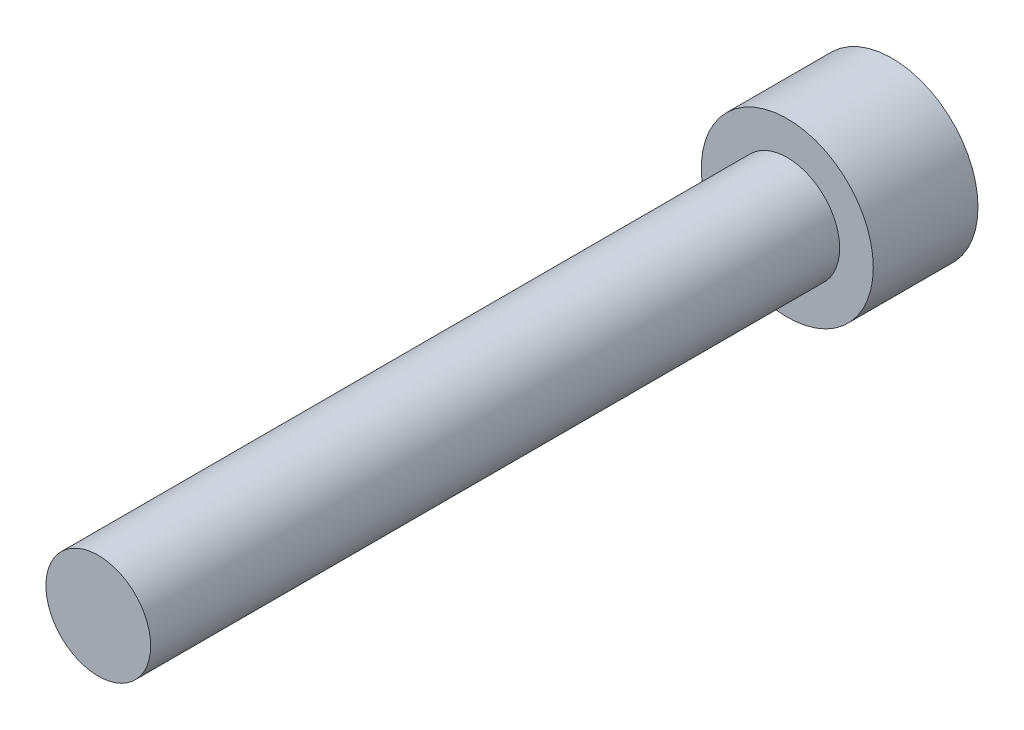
ISO-10303-21;
HEADER;
FILE_DESCRIPTION(('STEP AP214'),'2;1');
FILE_NAME('part.step','',(''),(''),'','','');
FILE_SCHEMA(('AUTOMOTIVE_DESIGN { 1 0 10303 214 1 1 1 1 }'));
ENDSEC;
DATA;
#1=APPLICATION_CONTEXT('core data for automotive mechanical design processes');
#2=APPLICATION_PROTOCOL_DEFINITION('international standard','automotive_design',2000,#1);
#3=PRODUCT_CONTEXT('',#1,'mechanical');
#4=PRODUCT('Part','Part','',(#3));
#5=PRODUCT_RELATED_PRODUCT_CATEGORY('part','',(#4));
#6=PRODUCT_DEFINITION_FORMATION('','',#4);
#7=PRODUCT_DEFINITION_CONTEXT('part definition',#1,'design');
#8=PRODUCT_DEFINITION('design','',#6,#7);
#9=PRODUCT_DEFINITION_SHAPE('','',#8);
#10=(LENGTH_UNIT() NAMED_UNIT(*) SI_UNIT(.MILLI.,.METRE.));
#11=(NAMED_UNIT(*) PLANE_ANGLE_UNIT() SI_UNIT($,.RADIAN.));
#12=(NAMED_UNIT(*) SI_UNIT($,.STERADIAN.) SOLID_ANGLE_UNIT());
#13=UNCERTAINTY_MEASURE_WITH_UNIT(LENGTH_MEASURE(1.E-05),#10,'distance_accuracy_value','');
#14=(GEOMETRIC_REPRESENTATION_CONTEXT(3) GLOBAL_UNCERTAINTY_ASSIGNED_CONTEXT((#13)) GLOBAL_UNIT_ASSIGNED_CONTEXT((#10,
#11,#12)) REPRESENTATION_CONTEXT('',''));
#15=CARTESIAN_POINT('',(0.,0.,0.));
#16=DIRECTION('',(0.,0.,1.));
#17=DIRECTION('',(1.,0.,0.));
#18=AXIS2_PLACEMENT_3D('',#15,#16,#17);
#19=CARTESIAN_POINT('',(0.,0.,31.75));
#20=DIRECTION('',(0.,0.,1.));
#21=DIRECTION('',(1.,0.,0.));
#22=AXIS2_PLACEMENT_3D('',#19,#20,#21);
#23=PLANE('',#22);
#24=CARTESIAN_POINT('',(0.,0.,31.75));
#25=DIRECTION('',(0.,0.,1.));
#26=DIRECTION('',(1.,0.,0.));
#27=AXIS2_PLACEMENT_3D('',#24,#25,#26);
#28=CIRCLE('',#27,2.413);
#29=CARTESIAN_POINT('',(2.413,0.,31.75));
#30=VERTEX_POINT('',#29);
#31=EDGE_CURVE('E11',#30,#30,#28,.T.);
#32=ORIENTED_EDGE('',*,*,#31,.T.);
#33=EDGE_LOOP('',(#32));
#34=FACE_BOUND('',#33,.T.);
#35=ADVANCED_FACE('F37',(#34),#23,.T.);
#36=CARTESIAN_POINT('',(0.,0.,31.75));
#37=DIRECTION('',(0.,0.,1.));
#38=DIRECTION('',(1.,0.,0.));
#39=AXIS2_PLACEMENT_3D('',#36,#37,#38);
#40=CYLINDRICAL_SURFACE('',#39,2.413);
#41=CARTESIAN_POINT('',(0.,0.,0.));
#42=DIRECTION('',(0.,0.,1.));
#43=DIRECTION('',(1.,0.,0.));
#44=AXIS2_PLACEMENT_3D('',#41,#42,#43);
#45=CIRCLE('',#44,2.413);
#46=CARTESIAN_POINT('',(2.413,0.,0.));
#47=VERTEX_POINT('',#46);
#48=EDGE_CURVE('E44',#47,#47,#45,.T.);
#49=ORIENTED_EDGE('',*,*,#48,.T.);
#50=EDGE_LOOP('',(#49));
#51=FACE_BOUND('',#50,.T.);
#52=ORIENTED_EDGE('',*,*,#31,.F.);
#53=EDGE_LOOP('',(#52));
#54=FACE_BOUND('',#53,.T.);
#55=ADVANCED_FACE('F151',(#51,#54),#40,.T.);
#56=CARTESIAN_POINT('',(0.,-2.413,0.));
#57=DIRECTION('',(0.,0.,1.));
#58=DIRECTION('',(1.,0.,0.));
#59=AXIS2_PLACEMENT_3D('',#56,#57,#58);
#60=PLANE('',#59);
#61=CARTESIAN_POINT('',(0.,0.,0.));
#62=DIRECTION('',(0.,0.,1.));
#63=DIRECTION('',(1.,0.,0.));
#64=AXIS2_PLACEMENT_3D('',#61,#62,#63);
#65=CIRCLE('',#64,3.9624);
#66=CARTESIAN_POINT('',(3.9624,0.,0.));
#67=VERTEX_POINT('',#66);
#68=EDGE_CURVE('E146',#67,#67,#65,.T.);
#69=ORIENTED_EDGE('',*,*,#68,.T.);
#70=EDGE_LOOP('',(#69));
#71=FACE_BOUND('',#70,.T.);
#72=ORIENTED_EDGE('',*,*,#48,.F.);
#73=EDGE_LOOP('',(#72));
#74=FACE_BOUND('',#73,.T.);
#75=ADVANCED_FACE('F154',(#71,#74),#60,.T.);
#76=CARTESIAN_POINT('',(0.,0.,31.75));
#77=DIRECTION('',(0.,0.,1.));
#78=DIRECTION('',(1.,0.,0.));
#79=AXIS2_PLACEMENT_3D('',#76,#77,#78);
#80=CYLINDRICAL_SURFACE('',#79,3.9624);
#81=CARTESIAN_POINT('',(0.,0.,-4.826));
#82=DIRECTION('',(0.,0.,1.));
#83=DIRECTION('',(1.,0.,0.));
#84=AXIS2_PLACEMENT_3D('',#81,#82,#83);
#85=CIRCLE('',#84,3.9624);
#86=CARTESIAN_POINT('',(3.9624,0.,-4.826));
#87=VERTEX_POINT('',#86);
#88=EDGE_CURVE('E138',#87,#87,#85,.T.);
#89=ORIENTED_EDGE('',*,*,#88,.T.);
#90=EDGE_LOOP('',(#89));
#91=FACE_BOUND('',#90,.T.);
#92=ORIENTED_EDGE('',*,*,#68,.F.);
#93=EDGE_LOOP('',(#92));
#94=FACE_BOUND('',#93,.T.);
#95=ADVANCED_FACE('F156',(#91,#94),#80,.T.);
#96=CARTESIAN_POINT('',(0.,-3.9624,-4.826));
#97=DIRECTION('',(0.,0.,-1.));
#98=DIRECTION('',(-1.,0.,0.));
#99=AXIS2_PLACEMENT_3D('',#96,#97,#98);
#100=PLANE('',#99);
#101=DIRECTION('',(0.866025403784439,-0.5,0.));
#102=VECTOR('',#101,1.);
#103=CARTESIAN_POINT('',(0.,2.28769270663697,-4.826));
#104=LINE('',#103,#102);
#105=CARTESIAN_POINT('',(0.,2.28769270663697,-4.826));
#106=VERTEX_POINT('',#105);
#107=CARTESIAN_POINT('',(1.9812,1.14384635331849,-4.826));
#108=VERTEX_POINT('',#107);
#109=EDGE_CURVE('E51',#106,#108,#104,.T.);
#110=ORIENTED_EDGE('',*,*,#109,.F.);
#111=DIRECTION('',(0.866025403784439,0.5,0.));
#112=VECTOR('',#111,1.);
#113=CARTESIAN_POINT('',(-1.9812,1.14384635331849,-4.826));
#114=LINE('',#113,#112);
#115=CARTESIAN_POINT('',(-1.9812,1.14384635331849,-4.826));
#116=VERTEX_POINT('',#115);
#117=EDGE_CURVE('E134',#116,#106,#114,.T.);
#118=ORIENTED_EDGE('',*,*,#117,.F.);
#119=DIRECTION('',(0.,1.,0.));
#120=VECTOR('',#119,1.);
#121=CARTESIAN_POINT('',(-1.9812,-1.14384635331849,-4.826));
#122=LINE('',#121,#120);
#123=CARTESIAN_POINT('',(-1.9812,-1.14384635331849,-4.826));
#124=VERTEX_POINT('',#123);
#125=EDGE_CURVE('E132',#124,#116,#122,.T.);
#126=ORIENTED_EDGE('',*,*,#125,.F.);
#127=DIRECTION('',(-0.866025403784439,0.5,0.));
#128=VECTOR('',#127,1.);
#129=CARTESIAN_POINT('',(0.,-2.28769270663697,-4.826));
#130=LINE('',#129,#128);
#131=CARTESIAN_POINT('',(0.,-2.28769270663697,-4.826));
#132=VERTEX_POINT('',#131);
#133=EDGE_CURVE('E99',#132,#124,#130,.T.);
#134=ORIENTED_EDGE('',*,*,#133,.F.);
#135=DIRECTION('',(-0.866025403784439,-0.5,0.));
#136=VECTOR('',#135,1.);
#137=CARTESIAN_POINT('',(1.9812,-1.14384635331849,-4.826));
#138=LINE('',#137,#136);
#139=CARTESIAN_POINT('',(1.9812,-1.14384635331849,-4.826));
#140=VERTEX_POINT('',#139);
#141=EDGE_CURVE('E128',#140,#132,#138,.T.);
#142=ORIENTED_EDGE('',*,*,#141,.F.);
#143=DIRECTION('',(0.,-1.,0.));
#144=VECTOR('',#143,1.);
#145=CARTESIAN_POINT('',(1.9812,1.14384635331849,-4.826));
#146=LINE('',#145,#144);
#147=EDGE_CURVE('E125',#108,#140,#146,.T.);
#148=ORIENTED_EDGE('',*,*,#147,.F.);
#149=EDGE_LOOP('',(#110,#118,#126,#134,#142,#148));
#150=FACE_BOUND('',#149,.T.);
#151=ORIENTED_EDGE('',*,*,#88,.F.);
#152=EDGE_LOOP('',(#151));
#153=FACE_BOUND('',#152,.T.);
#154=ADVANCED_FACE('F163',(#150,#153),#100,.T.);
#155=CARTESIAN_POINT('',(0.,2.28769270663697,-1.778));
#156=DIRECTION('',(0.5,0.866025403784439,0.));
#157=DIRECTION('',(-0.866025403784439,0.5,0.));
#158=AXIS2_PLACEMENT_3D('',#155,#156,#157);
#159=PLANE('',#158);
#160=ORIENTED_EDGE('',*,*,#109,.T.);
#161=DIRECTION('',(0.,0.,-1.));
#162=VECTOR('',#161,1.);
#163=CARTESIAN_POINT('',(1.9812,1.14384635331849,-1.778));
#164=LINE('',#163,#162);
#165=CARTESIAN_POINT('',(1.9812,1.14384635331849,-1.778));
#166=VERTEX_POINT('',#165);
#167=EDGE_CURVE('E81',#166,#108,#164,.T.);
#168=ORIENTED_EDGE('',*,*,#167,.F.);
#169=DIRECTION('',(0.866025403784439,-0.5,0.));
#170=VECTOR('',#169,1.);
#171=CARTESIAN_POINT('',(0.,2.28769270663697,-1.778));
#172=LINE('',#171,#170);
#173=CARTESIAN_POINT('',(0.,2.28769270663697,-1.778));
#174=VERTEX_POINT('',#173);
#175=EDGE_CURVE('E136',#174,#166,#172,.T.);
#176=ORIENTED_EDGE('',*,*,#175,.F.);
#177=DIRECTION('',(0.,0.,-1.));
#178=VECTOR('',#177,1.);
#179=CARTESIAN_POINT('',(0.,2.28769270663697,-1.778));
#180=LINE('',#179,#178);
#181=EDGE_CURVE('E59',#174,#106,#180,.T.);
#182=ORIENTED_EDGE('',*,*,#181,.T.);
#183=EDGE_LOOP('',(#160,#168,#176,#182));
#184=FACE_BOUND('',#183,.T.);
#185=ADVANCED_FACE('F197',(#184),#159,.F.);
#186=CARTESIAN_POINT('',(-1.9812,1.14384635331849,-1.778));
#187=DIRECTION('',(-0.5,0.866025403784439,0.));
#188=DIRECTION('',(-0.866025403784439,-0.5,0.));
#189=AXIS2_PLACEMENT_3D('',#186,#187,#188);
#190=PLANE('',#189);
#191=ORIENTED_EDGE('',*,*,#117,.T.);
#192=ORIENTED_EDGE('',*,*,#181,.F.);
#193=DIRECTION('',(0.866025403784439,0.5,0.));
#194=VECTOR('',#193,1.);
#195=CARTESIAN_POINT('',(-1.9812,1.14384635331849,-1.778));
#196=LINE('',#195,#194);
#197=CARTESIAN_POINT('',(-1.9812,1.14384635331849,-1.778));
#198=VERTEX_POINT('',#197);
#199=EDGE_CURVE('E111',#198,#174,#196,.T.);
#200=ORIENTED_EDGE('',*,*,#199,.F.);
#201=DIRECTION('',(0.,0.,-1.));
#202=VECTOR('',#201,1.);
#203=CARTESIAN_POINT('',(-1.9812,1.14384635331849,-1.778));
#204=LINE('',#203,#202);
#205=EDGE_CURVE('E103',#198,#116,#204,.T.);
#206=ORIENTED_EDGE('',*,*,#205,.T.);
#207=EDGE_LOOP('',(#191,#192,#200,#206));
#208=FACE_BOUND('',#207,.T.);
#209=ADVANCED_FACE('F208',(#208),#190,.F.);
#210=CARTESIAN_POINT('',(-1.9812,-1.14384635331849,-1.778));
#211=DIRECTION('',(-1.,0.,0.));
#212=DIRECTION('',(0.,-1.,0.));
#213=AXIS2_PLACEMENT_3D('',#210,#211,#212);
#214=PLANE('',#213);
#215=ORIENTED_EDGE('',*,*,#125,.T.);
#216=ORIENTED_EDGE('',*,*,#205,.F.);
#217=DIRECTION('',(0.,1.,0.));
#218=VECTOR('',#217,1.);
#219=CARTESIAN_POINT('',(-1.9812,-1.14384635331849,-1.778));
#220=LINE('',#219,#218);
#221=CARTESIAN_POINT('',(-1.9812,-1.14384635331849,-1.778));
#222=VERTEX_POINT('',#221);
#223=EDGE_CURVE('E107',#222,#198,#220,.T.);
#224=ORIENTED_EDGE('',*,*,#223,.F.);
#225=DIRECTION('',(0.,0.,-1.));
#226=VECTOR('',#225,1.);
#227=CARTESIAN_POINT('',(-1.9812,-1.14384635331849,-1.778));
#228=LINE('',#227,#226);
#229=EDGE_CURVE('E92',#222,#124,#228,.T.);
#230=ORIENTED_EDGE('',*,*,#229,.T.);
#231=EDGE_LOOP('',(#215,#216,#224,#230));
#232=FACE_BOUND('',#231,.T.);
#233=ADVANCED_FACE('F108',(#232),#214,.F.);
#234=CARTESIAN_POINT('',(0.,-2.28769270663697,-1.778));
#235=DIRECTION('',(-0.5,-0.866025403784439,0.));
#236=DIRECTION('',(0.866025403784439,-0.5,0.));
#237=AXIS2_PLACEMENT_3D('',#234,#235,#236);
#238=PLANE('',#237);
#239=ORIENTED_EDGE('',*,*,#133,.T.);
#240=ORIENTED_EDGE('',*,*,#229,.F.);
#241=DIRECTION('',(-0.866025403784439,0.5,0.));
#242=VECTOR('',#241,1.);
#243=CARTESIAN_POINT('',(0.,-2.28769270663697,-1.778));
#244=LINE('',#243,#242);
#245=CARTESIAN_POINT('',(0.,-2.28769270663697,-1.778));
#246=VERTEX_POINT('',#245);
#247=EDGE_CURVE('E96',#246,#222,#244,.T.);
#248=ORIENTED_EDGE('',*,*,#247,.F.);
#249=DIRECTION('',(0.,0.,-1.));
#250=VECTOR('',#249,1.);
#251=CARTESIAN_POINT('',(0.,-2.28769270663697,-1.778));
#252=LINE('',#251,#250);
#253=EDGE_CURVE('E104',#246,#132,#252,.T.);
#254=ORIENTED_EDGE('',*,*,#253,.T.);
#255=EDGE_LOOP('',(#239,#240,#248,#254));
#256=FACE_BOUND('',#255,.T.);
#257=ADVANCED_FACE('F94',(#256),#238,.F.);
#258=CARTESIAN_POINT('',(1.9812,-1.14384635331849,-1.778));
#259=DIRECTION('',(0.5,-0.866025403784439,0.));
#260=DIRECTION('',(0.866025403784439,0.5,0.));
#261=AXIS2_PLACEMENT_3D('',#258,#259,#260);
#262=PLANE('',#261);
#263=ORIENTED_EDGE('',*,*,#141,.T.);
#264=ORIENTED_EDGE('',*,*,#253,.F.);
#265=DIRECTION('',(-0.866025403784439,-0.5,0.));
#266=VECTOR('',#265,1.);
#267=CARTESIAN_POINT('',(1.9812,-1.14384635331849,-1.778));
#268=LINE('',#267,#266);
#269=CARTESIAN_POINT('',(1.9812,-1.14384635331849,-1.778));
#270=VERTEX_POINT('',#269);
#271=EDGE_CURVE('E117',#270,#246,#268,.T.);
#272=ORIENTED_EDGE('',*,*,#271,.F.);
#273=DIRECTION('',(0.,0.,-1.));
#274=VECTOR('',#273,1.);
#275=CARTESIAN_POINT('',(1.9812,-1.14384635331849,-1.778));
#276=LINE('',#275,#274);
#277=EDGE_CURVE('E141',#270,#140,#276,.T.);
#278=ORIENTED_EDGE('',*,*,#277,.T.);
#279=EDGE_LOOP('',(#263,#264,#272,#278));
#280=FACE_BOUND('',#279,.T.);
#281=ADVANCED_FACE('F236',(#280),#262,.F.);
#282=CARTESIAN_POINT('',(1.9812,1.14384635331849,-1.778));
#283=DIRECTION('',(1.,0.,0.));
#284=DIRECTION('',(0.,0.,-1.));
#285=AXIS2_PLACEMENT_3D('',#282,#283,#284);
#286=PLANE('',#285);
#287=ORIENTED_EDGE('',*,*,#147,.T.);
#288=ORIENTED_EDGE('',*,*,#277,.F.);
#289=DIRECTION('',(0.,-1.,0.));
#290=VECTOR('',#289,1.);
#291=CARTESIAN_POINT('',(1.9812,1.14384635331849,-1.778));
#292=LINE('',#291,#290);
#293=EDGE_CURVE('E119',#166,#270,#292,.T.);
#294=ORIENTED_EDGE('',*,*,#293,.F.);
#295=ORIENTED_EDGE('',*,*,#167,.T.);
#296=EDGE_LOOP('',(#287,#288,#294,#295));
#297=FACE_BOUND('',#296,.T.);
#298=ADVANCED_FACE('F246',(#297),#286,.F.);
#299=CARTESIAN_POINT('',(3.9624,0.,-1.778));
#300=DIRECTION('',(0.,0.,-1.));
#301=DIRECTION('',(-1.,0.,0.));
#302=AXIS2_PLACEMENT_3D('',#299,#300,#301);
#303=PLANE('',#302);
#304=ORIENTED_EDGE('',*,*,#175,.T.);
#305=ORIENTED_EDGE('',*,*,#293,.T.);
#306=ORIENTED_EDGE('',*,*,#271,.T.);
#307=ORIENTED_EDGE('',*,*,#247,.T.);
#308=ORIENTED_EDGE('',*,*,#223,.T.);
#309=ORIENTED_EDGE('',*,*,#199,.T.);
#310=EDGE_LOOP('',(#304,#305,#306,#307,#308,#309));
#311=FACE_BOUND('',#310,.T.);
#312=ADVANCED_FACE('F114',(#311),#303,.T.);
#313=CLOSED_SHELL('',(#35,#55,#75,#95,#154,#185,#209,#233,#257,#281,#298,#312));
#314=MANIFOLD_SOLID_BREP('B2',#313);
#315=ADVANCED_BREP_SHAPE_REPRESENTATION('',(#18,#314),#14);
#316=SHAPE_DEFINITION_REPRESENTATION(#9,#315);
ENDSEC;
END-ISO-10303-21;
